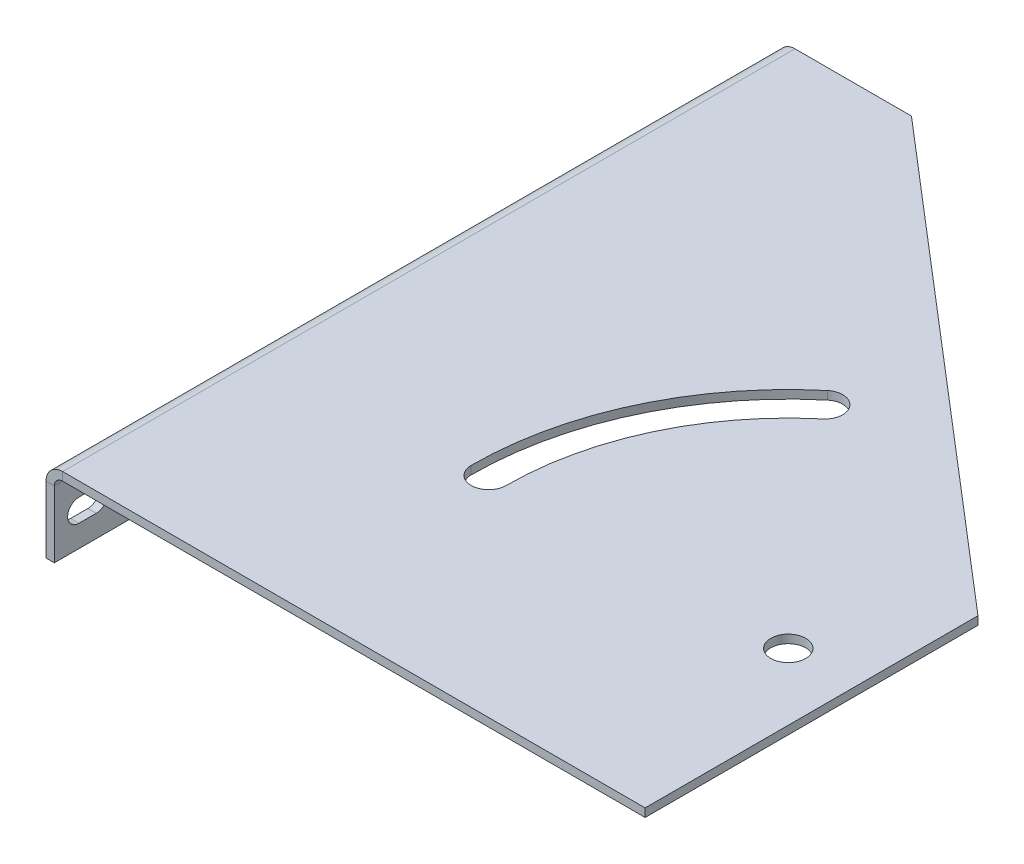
ISO-10303-21;
HEADER;
FILE_DESCRIPTION(('STEP AP214'),'2;1');
FILE_NAME('part.step','',(''),(''),'','','');
FILE_SCHEMA(('AUTOMOTIVE_DESIGN { 1 0 10303 214 1 1 1 1 }'));
ENDSEC;
DATA;
#1=APPLICATION_CONTEXT('core data for automotive mechanical design processes');
#2=APPLICATION_PROTOCOL_DEFINITION('international standard','automotive_design',2000,#1);
#3=PRODUCT_CONTEXT('',#1,'mechanical');
#4=PRODUCT('Part','Part','',(#3));
#5=PRODUCT_RELATED_PRODUCT_CATEGORY('part','',(#4));
#6=PRODUCT_DEFINITION_FORMATION('','',#4);
#7=PRODUCT_DEFINITION_CONTEXT('part definition',#1,'design');
#8=PRODUCT_DEFINITION('design','',#6,#7);
#9=PRODUCT_DEFINITION_SHAPE('','',#8);
#10=(LENGTH_UNIT() NAMED_UNIT(*) SI_UNIT(.MILLI.,.METRE.));
#11=(NAMED_UNIT(*) PLANE_ANGLE_UNIT() SI_UNIT($,.RADIAN.));
#12=(NAMED_UNIT(*) SI_UNIT($,.STERADIAN.) SOLID_ANGLE_UNIT());
#13=UNCERTAINTY_MEASURE_WITH_UNIT(LENGTH_MEASURE(1.E-05),#10,'distance_accuracy_value','');
#14=(GEOMETRIC_REPRESENTATION_CONTEXT(3) GLOBAL_UNCERTAINTY_ASSIGNED_CONTEXT((#13)) GLOBAL_UNIT_ASSIGNED_CONTEXT((#10,
#11,#12)) REPRESENTATION_CONTEXT('',''));
#15=CARTESIAN_POINT('',(0.,0.,0.));
#16=DIRECTION('',(0.,0.,1.));
#17=DIRECTION('',(1.,0.,0.));
#18=AXIS2_PLACEMENT_3D('',#15,#16,#17);
#19=CARTESIAN_POINT('',(0.,20.,-220.));
#20=DIRECTION('',(0.,0.,-1.));
#21=DIRECTION('',(-1.,0.,0.));
#22=AXIS2_PLACEMENT_3D('',#19,#20,#21);
#23=PLANE('',#22);
#24=DIRECTION('',(1.,0.,0.));
#25=VECTOR('',#24,1.);
#26=CARTESIAN_POINT('',(0.,20.,-220.));
#27=LINE('',#26,#25);
#28=CARTESIAN_POINT('',(0.,20.,-220.));
#29=VERTEX_POINT('',#28);
#30=CARTESIAN_POINT('',(2.5,20.,-220.));
#31=VERTEX_POINT('',#30);
#32=EDGE_CURVE('E361',#29,#31,#27,.T.);
#33=ORIENTED_EDGE('',*,*,#32,.F.);
#34=CARTESIAN_POINT('',(5.,20.,-220.));
#35=DIRECTION('',(0.,0.,1.));
#36=DIRECTION('',(1.,0.,0.));
#37=AXIS2_PLACEMENT_3D('',#34,#35,#36);
#38=CIRCLE('',#37,5.);
#39=CARTESIAN_POINT('',(5.,25.,-220.));
#40=VERTEX_POINT('',#39);
#41=EDGE_CURVE('E305',#29,#40,#38,.F.);
#42=ORIENTED_EDGE('',*,*,#41,.T.);
#43=DIRECTION('',(0.,1.,0.));
#44=VECTOR('',#43,1.);
#45=CARTESIAN_POINT('',(5.,22.5,-220.));
#46=LINE('',#45,#44);
#47=CARTESIAN_POINT('',(5.,22.5,-220.));
#48=VERTEX_POINT('',#47);
#49=EDGE_CURVE('E358',#48,#40,#46,.T.);
#50=ORIENTED_EDGE('',*,*,#49,.F.);
#51=CARTESIAN_POINT('',(5.,20.,-220.));
#52=DIRECTION('',(0.,0.,1.));
#53=DIRECTION('',(1.,0.,0.));
#54=AXIS2_PLACEMENT_3D('',#51,#52,#53);
#55=CIRCLE('',#54,2.5);
#56=EDGE_CURVE('E319',#31,#48,#55,.F.);
#57=ORIENTED_EDGE('',*,*,#56,.F.);
#58=EDGE_LOOP('',(#33,#42,#50,#57));
#59=FACE_BOUND('',#58,.T.);
#60=ADVANCED_FACE('F52',(#59),#23,.T.);
#61=CARTESIAN_POINT('',(5.,22.5,-220.));
#62=DIRECTION('',(0.,0.,-1.));
#63=DIRECTION('',(-1.,0.,0.));
#64=AXIS2_PLACEMENT_3D('',#61,#62,#63);
#65=PLANE('',#64);
#66=DIRECTION('',(0.,1.,0.));
#67=VECTOR('',#66,1.);
#68=CARTESIAN_POINT('',(0.,0.,-220.));
#69=LINE('',#68,#67);
#70=CARTESIAN_POINT('',(0.,0.,-220.));
#71=VERTEX_POINT('',#70);
#72=EDGE_CURVE('E309',#71,#29,#69,.T.);
#73=ORIENTED_EDGE('',*,*,#72,.T.);
#74=ORIENTED_EDGE('',*,*,#32,.T.);
#75=DIRECTION('',(0.,1.,0.));
#76=VECTOR('',#75,1.);
#77=CARTESIAN_POINT('',(2.5,0.,-220.));
#78=LINE('',#77,#76);
#79=CARTESIAN_POINT('',(2.5,0.,-220.));
#80=VERTEX_POINT('',#79);
#81=EDGE_CURVE('E315',#80,#31,#78,.T.);
#82=ORIENTED_EDGE('',*,*,#81,.F.);
#83=DIRECTION('',(-1.,0.,0.));
#84=VECTOR('',#83,1.);
#85=CARTESIAN_POINT('',(2.5,0.,-220.));
#86=LINE('',#85,#84);
#87=EDGE_CURVE('E313',#80,#71,#86,.T.);
#88=ORIENTED_EDGE('',*,*,#87,.T.);
#89=EDGE_LOOP('',(#73,#74,#82,#88));
#90=FACE_BOUND('',#89,.T.);
#91=ADVANCED_FACE('F422',(#90),#65,.T.);
#92=CARTESIAN_POINT('',(5.,25.,0.));
#93=DIRECTION('',(0.,0.,1.));
#94=DIRECTION('',(1.,0.,0.));
#95=AXIS2_PLACEMENT_3D('',#92,#93,#94);
#96=PLANE('',#95);
#97=DIRECTION('',(0.,-1.,0.));
#98=VECTOR('',#97,1.);
#99=CARTESIAN_POINT('',(5.,25.,0.));
#100=LINE('',#99,#98);
#101=CARTESIAN_POINT('',(5.,25.,0.));
#102=VERTEX_POINT('',#101);
#103=CARTESIAN_POINT('',(5.,22.5,0.));
#104=VERTEX_POINT('',#103);
#105=EDGE_CURVE('E355',#102,#104,#100,.T.);
#106=ORIENTED_EDGE('',*,*,#105,.F.);
#107=CARTESIAN_POINT('',(5.,20.,0.));
#108=DIRECTION('',(0.,0.,1.));
#109=DIRECTION('',(1.,0.,0.));
#110=AXIS2_PLACEMENT_3D('',#107,#108,#109);
#111=CIRCLE('',#110,5.);
#112=CARTESIAN_POINT('',(0.,20.,0.));
#113=VERTEX_POINT('',#112);
#114=EDGE_CURVE('E278',#113,#102,#111,.F.);
#115=ORIENTED_EDGE('',*,*,#114,.F.);
#116=DIRECTION('',(-1.,0.,0.));
#117=VECTOR('',#116,1.);
#118=CARTESIAN_POINT('',(2.5,20.,0.));
#119=LINE('',#118,#117);
#120=CARTESIAN_POINT('',(2.5,20.,0.));
#121=VERTEX_POINT('',#120);
#122=EDGE_CURVE('E328',#121,#113,#119,.T.);
#123=ORIENTED_EDGE('',*,*,#122,.F.);
#124=CARTESIAN_POINT('',(5.,20.,0.));
#125=DIRECTION('',(0.,0.,1.));
#126=DIRECTION('',(1.,0.,0.));
#127=AXIS2_PLACEMENT_3D('',#124,#125,#126);
#128=CIRCLE('',#127,2.5);
#129=EDGE_CURVE('E293',#121,#104,#128,.F.);
#130=ORIENTED_EDGE('',*,*,#129,.T.);
#131=EDGE_LOOP('',(#106,#115,#123,#130));
#132=FACE_BOUND('',#131,.T.);
#133=ADVANCED_FACE('F406',(#132),#96,.T.);
#134=CARTESIAN_POINT('',(2.5,20.,0.));
#135=DIRECTION('',(0.,0.,1.));
#136=DIRECTION('',(1.,0.,0.));
#137=AXIS2_PLACEMENT_3D('',#134,#135,#136);
#138=PLANE('',#137);
#139=DIRECTION('',(1.,0.,0.));
#140=VECTOR('',#139,1.);
#141=CARTESIAN_POINT('',(0.,25.,0.));
#142=LINE('',#141,#140);
#143=CARTESIAN_POINT('',(180.,25.,0.));
#144=VERTEX_POINT('',#143);
#145=EDGE_CURVE('E274',#102,#144,#142,.T.);
#146=ORIENTED_EDGE('',*,*,#145,.F.);
#147=ORIENTED_EDGE('',*,*,#105,.T.);
#148=DIRECTION('',(1.,0.,0.));
#149=VECTOR('',#148,1.);
#150=CARTESIAN_POINT('',(0.,22.5,0.));
#151=LINE('',#150,#149);
#152=CARTESIAN_POINT('',(180.,22.5,0.));
#153=VERTEX_POINT('',#152);
#154=EDGE_CURVE('E266',#104,#153,#151,.T.);
#155=ORIENTED_EDGE('',*,*,#154,.T.);
#156=DIRECTION('',(0.,-1.,0.));
#157=VECTOR('',#156,1.);
#158=CARTESIAN_POINT('',(180.,25.,0.));
#159=LINE('',#158,#157);
#160=EDGE_CURVE('E270',#144,#153,#159,.T.);
#161=ORIENTED_EDGE('',*,*,#160,.F.);
#162=EDGE_LOOP('',(#146,#147,#155,#161));
#163=FACE_BOUND('',#162,.T.);
#164=ADVANCED_FACE('F404',(#163),#138,.T.);
#165=CARTESIAN_POINT('',(0.,22.5,-220.));
#166=DIRECTION('',(0.,-1.,0.));
#167=DIRECTION('',(0.,0.,-1.));
#168=AXIS2_PLACEMENT_3D('',#165,#166,#167);
#169=PLANE('',#168);
#170=CARTESIAN_POINT('',(160.,22.5,-63.));
#171=DIRECTION('',(0.,-1.,0.));
#172=DIRECTION('',(0.,0.,-1.));
#173=AXIS2_PLACEMENT_3D('',#170,#171,#172);
#174=CIRCLE('',#173,84.75);
#175=CARTESIAN_POINT('',(105.523750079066,22.5,-127.922266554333));
#176=VERTEX_POINT('',#175);
#177=CARTESIAN_POINT('',(75.25,22.5,-63.));
#178=VERTEX_POINT('',#177);
#179=EDGE_CURVE('E256',#176,#178,#174,.F.);
#180=ORIENTED_EDGE('',*,*,#179,.F.);
#181=CARTESIAN_POINT('',(102.149115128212,22.5,-131.943999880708));
#182=DIRECTION('',(0.,-1.,0.));
#183=DIRECTION('',(0.,0.,-1.));
#184=AXIS2_PLACEMENT_3D('',#181,#182,#183);
#185=CIRCLE('',#184,5.25);
#186=CARTESIAN_POINT('',(98.7744801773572,22.5,-135.965733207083));
#187=VERTEX_POINT('',#186);
#188=EDGE_CURVE('E237',#187,#176,#185,.T.);
#189=ORIENTED_EDGE('',*,*,#188,.F.);
#190=CARTESIAN_POINT('',(160.,22.5,-63.));
#191=DIRECTION('',(0.,-1.,0.));
#192=DIRECTION('',(0.,0.,-1.));
#193=AXIS2_PLACEMENT_3D('',#190,#191,#192);
#194=CIRCLE('',#193,95.25);
#195=CARTESIAN_POINT('',(64.75,22.5,-63.));
#196=VERTEX_POINT('',#195);
#197=EDGE_CURVE('E249',#196,#187,#194,.T.);
#198=ORIENTED_EDGE('',*,*,#197,.F.);
#199=CARTESIAN_POINT('',(70.,22.5,-63.));
#200=DIRECTION('',(0.,-1.,0.));
#201=DIRECTION('',(0.,0.,-1.));
#202=AXIS2_PLACEMENT_3D('',#199,#200,#201);
#203=CIRCLE('',#202,5.25);
#204=EDGE_CURVE('E253',#178,#196,#203,.T.);
#205=ORIENTED_EDGE('',*,*,#204,.F.);
#206=EDGE_LOOP('',(#180,#189,#198,#205));
#207=FACE_BOUND('',#206,.T.);
#208=CARTESIAN_POINT('',(160.,22.5,-63.));
#209=DIRECTION('',(0.,-1.,0.));
#210=DIRECTION('',(0.,0.,-1.));
#211=AXIS2_PLACEMENT_3D('',#208,#209,#210);
#212=CIRCLE('',#211,5.25);
#213=CARTESIAN_POINT('',(160.,22.5,-68.25));
#214=VERTEX_POINT('',#213);
#215=EDGE_CURVE('E262',#214,#214,#212,.T.);
#216=ORIENTED_EDGE('',*,*,#215,.F.);
#217=EDGE_LOOP('',(#216));
#218=FACE_BOUND('',#217,.T.);
#219=DIRECTION('',(1.,0.,0.));
#220=VECTOR('',#219,1.);
#221=CARTESIAN_POINT('',(0.,22.5,-220.));
#222=LINE('',#221,#220);
#223=CARTESIAN_POINT('',(39.9999999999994,22.5,-220.));
#224=VERTEX_POINT('',#223);
#225=EDGE_CURVE('E297',#48,#224,#222,.T.);
#226=ORIENTED_EDGE('',*,*,#225,.T.);
#227=DIRECTION('',(-0.759256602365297,0.,-0.650791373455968));
#228=VECTOR('',#227,1.);
#229=CARTESIAN_POINT('',(16.941176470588,22.5,-239.764705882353));
#230=LINE('',#229,#228);
#231=CARTESIAN_POINT('',(180.,22.5,-99.9999999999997));
#232=VERTEX_POINT('',#231);
#233=EDGE_CURVE('E368',#224,#232,#230,.F.);
#234=ORIENTED_EDGE('',*,*,#233,.T.);
#235=DIRECTION('',(0.,0.,1.));
#236=VECTOR('',#235,1.);
#237=CARTESIAN_POINT('',(180.,22.5,-220.));
#238=LINE('',#237,#236);
#239=EDGE_CURVE('E323',#232,#153,#238,.T.);
#240=ORIENTED_EDGE('',*,*,#239,.T.);
#241=ORIENTED_EDGE('',*,*,#154,.F.);
#242=DIRECTION('',(0.,0.,1.));
#243=VECTOR('',#242,1.);
#244=CARTESIAN_POINT('',(5.,22.5,-220.));
#245=LINE('',#244,#243);
#246=EDGE_CURVE('E324',#48,#104,#245,.T.);
#247=ORIENTED_EDGE('',*,*,#246,.F.);
#248=EDGE_LOOP('',(#226,#234,#240,#241,#247));
#249=FACE_BOUND('',#248,.T.);
#250=ADVANCED_FACE('F390',(#207,#218,#249),#169,.T.);
#251=CARTESIAN_POINT('',(5.,20.,-220.));
#252=DIRECTION('',(0.,0.,1.));
#253=DIRECTION('',(1.,0.,0.));
#254=AXIS2_PLACEMENT_3D('',#251,#252,#253);
#255=CYLINDRICAL_SURFACE('',#254,2.5);
#256=ORIENTED_EDGE('',*,*,#129,.F.);
#257=DIRECTION('',(0.,0.,1.));
#258=VECTOR('',#257,1.);
#259=CARTESIAN_POINT('',(2.5,20.,-220.));
#260=LINE('',#259,#258);
#261=EDGE_CURVE('E329',#31,#121,#260,.T.);
#262=ORIENTED_EDGE('',*,*,#261,.F.);
#263=ORIENTED_EDGE('',*,*,#56,.T.);
#264=ORIENTED_EDGE('',*,*,#246,.T.);
#265=EDGE_LOOP('',(#256,#262,#263,#264));
#266=FACE_BOUND('',#265,.T.);
#267=ADVANCED_FACE('F394',(#266),#255,.F.);
#268=CARTESIAN_POINT('',(2.5,0.,-220.));
#269=DIRECTION('',(1.,0.,0.));
#270=DIRECTION('',(0.,0.,-1.));
#271=AXIS2_PLACEMENT_3D('',#268,#269,#270);
#272=PLANE('',#271);
#273=CARTESIAN_POINT('',(2.5,10.,-45.));
#274=DIRECTION('',(1.,0.,0.));
#275=DIRECTION('',(0.,0.,-1.));
#276=AXIS2_PLACEMENT_3D('',#273,#274,#275);
#277=CIRCLE('',#276,3.39999999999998);
#278=CARTESIAN_POINT('',(2.5,10.,-48.4));
#279=VERTEX_POINT('',#278);
#280=EDGE_CURVE('E501',#279,#279,#277,.T.);
#281=ORIENTED_EDGE('',*,*,#280,.F.);
#282=EDGE_LOOP('',(#281));
#283=FACE_BOUND('',#282,.T.);
#284=CARTESIAN_POINT('',(2.5,10.,-205.));
#285=DIRECTION('',(1.,0.,0.));
#286=DIRECTION('',(0.,0.,-1.));
#287=AXIS2_PLACEMENT_3D('',#284,#285,#286);
#288=CIRCLE('',#287,3.39999999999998);
#289=CARTESIAN_POINT('',(2.5,10.,-208.4));
#290=VERTEX_POINT('',#289);
#291=EDGE_CURVE('E514',#290,#290,#288,.T.);
#292=ORIENTED_EDGE('',*,*,#291,.F.);
#293=EDGE_LOOP('',(#292));
#294=FACE_BOUND('',#293,.T.);
#295=CARTESIAN_POINT('',(2.5,9.99999999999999,-12.6));
#296=DIRECTION('',(1.,0.,0.));
#297=DIRECTION('',(0.,0.,-1.));
#298=AXIS2_PLACEMENT_3D('',#295,#296,#297);
#299=CIRCLE('',#298,3.4);
#300=CARTESIAN_POINT('',(2.50000000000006,6.59999999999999,-12.6));
#301=VERTEX_POINT('',#300);
#302=CARTESIAN_POINT('',(2.50000000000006,13.4,-12.6));
#303=VERTEX_POINT('',#302);
#304=EDGE_CURVE('E215',#301,#303,#299,.T.);
#305=ORIENTED_EDGE('',*,*,#304,.F.);
#306=DIRECTION('',(0.,0.,-1.));
#307=VECTOR('',#306,1.);
#308=CARTESIAN_POINT('',(2.5,6.59999999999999,-220.));
#309=LINE('',#308,#307);
#310=CARTESIAN_POINT('',(2.5,6.59999999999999,-7.39999999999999));
#311=VERTEX_POINT('',#310);
#312=EDGE_CURVE('E203',#311,#301,#309,.T.);
#313=ORIENTED_EDGE('',*,*,#312,.F.);
#314=CARTESIAN_POINT('',(2.5,9.99999999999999,-7.39999999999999));
#315=DIRECTION('',(1.,0.,0.));
#316=DIRECTION('',(0.,0.,-1.));
#317=AXIS2_PLACEMENT_3D('',#314,#315,#316);
#318=CIRCLE('',#317,3.4);
#319=CARTESIAN_POINT('',(2.50000000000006,13.4,-7.39999999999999));
#320=VERTEX_POINT('',#319);
#321=EDGE_CURVE('E176',#320,#311,#318,.T.);
#322=ORIENTED_EDGE('',*,*,#321,.F.);
#323=DIRECTION('',(0.,0.,1.));
#324=VECTOR('',#323,1.);
#325=CARTESIAN_POINT('',(2.5,13.4,-220.));
#326=LINE('',#325,#324);
#327=EDGE_CURVE('E212',#303,#320,#326,.T.);
#328=ORIENTED_EDGE('',*,*,#327,.F.);
#329=EDGE_LOOP('',(#305,#313,#322,#328));
#330=FACE_BOUND('',#329,.T.);
#331=DIRECTION('',(0.,1.,0.));
#332=VECTOR('',#331,1.);
#333=CARTESIAN_POINT('',(2.5,0.,0.));
#334=LINE('',#333,#332);
#335=CARTESIAN_POINT('',(2.5,0.,0.));
#336=VERTEX_POINT('',#335);
#337=EDGE_CURVE('E289',#336,#121,#334,.T.);
#338=ORIENTED_EDGE('',*,*,#337,.F.);
#339=DIRECTION('',(0.,0.,1.));
#340=VECTOR('',#339,1.);
#341=CARTESIAN_POINT('',(2.5,0.,-220.));
#342=LINE('',#341,#340);
#343=EDGE_CURVE('E333',#80,#336,#342,.T.);
#344=ORIENTED_EDGE('',*,*,#343,.F.);
#345=ORIENTED_EDGE('',*,*,#81,.T.);
#346=ORIENTED_EDGE('',*,*,#261,.T.);
#347=EDGE_LOOP('',(#338,#344,#345,#346));
#348=FACE_BOUND('',#347,.T.);
#349=ADVANCED_FACE('F411',(#283,#294,#330,#348),#272,.T.);
#350=CARTESIAN_POINT('',(2.5,0.,-220.));
#351=DIRECTION('',(0.,1.,0.));
#352=DIRECTION('',(0.,0.,1.));
#353=AXIS2_PLACEMENT_3D('',#350,#351,#352);
#354=PLANE('',#353);
#355=DIRECTION('',(-1.,0.,0.));
#356=VECTOR('',#355,1.);
#357=CARTESIAN_POINT('',(2.5,0.,0.));
#358=LINE('',#357,#356);
#359=CARTESIAN_POINT('',(0.,0.,0.));
#360=VERTEX_POINT('',#359);
#361=EDGE_CURVE('E286',#336,#360,#358,.T.);
#362=ORIENTED_EDGE('',*,*,#361,.T.);
#363=DIRECTION('',(0.,0.,1.));
#364=VECTOR('',#363,1.);
#365=CARTESIAN_POINT('',(0.,0.,-220.));
#366=LINE('',#365,#364);
#367=EDGE_CURVE('E336',#71,#360,#366,.T.);
#368=ORIENTED_EDGE('',*,*,#367,.F.);
#369=ORIENTED_EDGE('',*,*,#87,.F.);
#370=ORIENTED_EDGE('',*,*,#343,.T.);
#371=EDGE_LOOP('',(#362,#368,#369,#370));
#372=FACE_BOUND('',#371,.T.);
#373=ADVANCED_FACE('F417',(#372),#354,.F.);
#374=CARTESIAN_POINT('',(0.,0.,-220.));
#375=DIRECTION('',(1.,0.,0.));
#376=DIRECTION('',(0.,0.,-1.));
#377=AXIS2_PLACEMENT_3D('',#374,#375,#376);
#378=PLANE('',#377);
#379=CARTESIAN_POINT('',(0.,10.,-45.));
#380=DIRECTION('',(-1.,0.,0.));
#381=DIRECTION('',(0.,0.,1.));
#382=AXIS2_PLACEMENT_3D('',#379,#380,#381);
#383=CIRCLE('',#382,3.39999999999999);
#384=CARTESIAN_POINT('',(0.,10.,-41.6));
#385=VERTEX_POINT('',#384);
#386=EDGE_CURVE('E504',#385,#385,#383,.T.);
#387=ORIENTED_EDGE('',*,*,#386,.F.);
#388=EDGE_LOOP('',(#387));
#389=FACE_BOUND('',#388,.T.);
#390=CARTESIAN_POINT('',(0.,10.,-205.));
#391=DIRECTION('',(-1.,0.,0.));
#392=DIRECTION('',(0.,0.,1.));
#393=AXIS2_PLACEMENT_3D('',#390,#391,#392);
#394=CIRCLE('',#393,3.39999999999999);
#395=CARTESIAN_POINT('',(0.,10.,-201.6));
#396=VERTEX_POINT('',#395);
#397=EDGE_CURVE('E508',#396,#396,#394,.T.);
#398=ORIENTED_EDGE('',*,*,#397,.F.);
#399=EDGE_LOOP('',(#398));
#400=FACE_BOUND('',#399,.T.);
#401=DIRECTION('',(0.,0.,1.));
#402=VECTOR('',#401,1.);
#403=CARTESIAN_POINT('',(0.,6.59999999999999,-12.6));
#404=LINE('',#403,#402);
#405=CARTESIAN_POINT('',(0.,6.59999999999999,-12.6));
#406=VERTEX_POINT('',#405);
#407=CARTESIAN_POINT('',(0.,6.59999999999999,-7.39999999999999));
#408=VERTEX_POINT('',#407);
#409=EDGE_CURVE('E183',#406,#408,#404,.T.);
#410=ORIENTED_EDGE('',*,*,#409,.F.);
#411=CARTESIAN_POINT('',(0.,9.99999999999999,-12.6));
#412=DIRECTION('',(-1.,0.,0.));
#413=DIRECTION('',(0.,0.,-1.));
#414=AXIS2_PLACEMENT_3D('',#411,#412,#413);
#415=CIRCLE('',#414,3.4);
#416=CARTESIAN_POINT('',(0.,13.4,-12.6));
#417=VERTEX_POINT('',#416);
#418=EDGE_CURVE('E75',#417,#406,#415,.T.);
#419=ORIENTED_EDGE('',*,*,#418,.F.);
#420=DIRECTION('',(0.,0.,-1.));
#421=VECTOR('',#420,1.);
#422=CARTESIAN_POINT('',(0.,13.4,-12.6));
#423=LINE('',#422,#421);
#424=CARTESIAN_POINT('',(0.,13.4,-7.39999999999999));
#425=VERTEX_POINT('',#424);
#426=EDGE_CURVE('E191',#425,#417,#423,.T.);
#427=ORIENTED_EDGE('',*,*,#426,.F.);
#428=CARTESIAN_POINT('',(0.,9.99999999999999,-7.39999999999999));
#429=DIRECTION('',(-1.,0.,0.));
#430=DIRECTION('',(0.,0.,1.));
#431=AXIS2_PLACEMENT_3D('',#428,#429,#430);
#432=CIRCLE('',#431,3.4);
#433=EDGE_CURVE('E173',#408,#425,#432,.T.);
#434=ORIENTED_EDGE('',*,*,#433,.F.);
#435=EDGE_LOOP('',(#410,#419,#427,#434));
#436=FACE_BOUND('',#435,.T.);
#437=DIRECTION('',(0.,1.,0.));
#438=VECTOR('',#437,1.);
#439=CARTESIAN_POINT('',(0.,0.,0.));
#440=LINE('',#439,#438);
#441=EDGE_CURVE('E282',#360,#113,#440,.T.);
#442=ORIENTED_EDGE('',*,*,#441,.T.);
#443=DIRECTION('',(0.,0.,1.));
#444=VECTOR('',#443,1.);
#445=CARTESIAN_POINT('',(0.,20.,-220.));
#446=LINE('',#445,#444);
#447=EDGE_CURVE('E340',#29,#113,#446,.T.);
#448=ORIENTED_EDGE('',*,*,#447,.F.);
#449=ORIENTED_EDGE('',*,*,#72,.F.);
#450=ORIENTED_EDGE('',*,*,#367,.T.);
#451=EDGE_LOOP('',(#442,#448,#449,#450));
#452=FACE_BOUND('',#451,.T.);
#453=ADVANCED_FACE('F188',(#389,#400,#436,#452),#378,.F.);
#454=CARTESIAN_POINT('',(5.,20.,-220.));
#455=DIRECTION('',(0.,0.,1.));
#456=DIRECTION('',(1.,0.,0.));
#457=AXIS2_PLACEMENT_3D('',#454,#455,#456);
#458=CYLINDRICAL_SURFACE('',#457,5.);
#459=ORIENTED_EDGE('',*,*,#114,.T.);
#460=DIRECTION('',(0.,0.,1.));
#461=VECTOR('',#460,1.);
#462=CARTESIAN_POINT('',(5.,25.,-220.));
#463=LINE('',#462,#461);
#464=EDGE_CURVE('E344',#40,#102,#463,.T.);
#465=ORIENTED_EDGE('',*,*,#464,.F.);
#466=ORIENTED_EDGE('',*,*,#41,.F.);
#467=ORIENTED_EDGE('',*,*,#447,.T.);
#468=EDGE_LOOP('',(#459,#465,#466,#467));
#469=FACE_BOUND('',#468,.T.);
#470=ADVANCED_FACE('F401',(#469),#458,.T.);
#471=CARTESIAN_POINT('',(0.,25.,-220.));
#472=DIRECTION('',(0.,-1.,0.));
#473=DIRECTION('',(0.,0.,-1.));
#474=AXIS2_PLACEMENT_3D('',#471,#472,#473);
#475=PLANE('',#474);
#476=CARTESIAN_POINT('',(102.149115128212,25.,-131.943999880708));
#477=DIRECTION('',(0.,1.,0.));
#478=DIRECTION('',(0.,0.,1.));
#479=AXIS2_PLACEMENT_3D('',#476,#477,#478);
#480=CIRCLE('',#479,5.25);
#481=CARTESIAN_POINT('',(105.523750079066,25.,-127.922266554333));
#482=VERTEX_POINT('',#481);
#483=CARTESIAN_POINT('',(98.7744801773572,25.,-135.965733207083));
#484=VERTEX_POINT('',#483);
#485=EDGE_CURVE('E221',#482,#484,#480,.T.);
#486=ORIENTED_EDGE('',*,*,#485,.F.);
#487=CARTESIAN_POINT('',(160.,25.,-63.));
#488=DIRECTION('',(0.,-1.,0.));
#489=DIRECTION('',(0.,0.,-1.));
#490=AXIS2_PLACEMENT_3D('',#487,#488,#489);
#491=CIRCLE('',#490,84.75);
#492=CARTESIAN_POINT('',(75.25,25.,-63.));
#493=VERTEX_POINT('',#492);
#494=EDGE_CURVE('E218',#493,#482,#491,.T.);
#495=ORIENTED_EDGE('',*,*,#494,.F.);
#496=CARTESIAN_POINT('',(70.,25.,-63.));
#497=DIRECTION('',(0.,1.,0.));
#498=DIRECTION('',(0.,0.,1.));
#499=AXIS2_PLACEMENT_3D('',#496,#497,#498);
#500=CIRCLE('',#499,5.25);
#501=CARTESIAN_POINT('',(64.75,25.,-63.));
#502=VERTEX_POINT('',#501);
#503=EDGE_CURVE('E229',#502,#493,#500,.T.);
#504=ORIENTED_EDGE('',*,*,#503,.F.);
#505=CARTESIAN_POINT('',(160.,25.,-63.));
#506=DIRECTION('',(0.,1.,0.));
#507=DIRECTION('',(0.,0.,-1.));
#508=AXIS2_PLACEMENT_3D('',#505,#506,#507);
#509=CIRCLE('',#508,95.25);
#510=EDGE_CURVE('E225',#484,#502,#509,.T.);
#511=ORIENTED_EDGE('',*,*,#510,.F.);
#512=EDGE_LOOP('',(#486,#495,#504,#511));
#513=FACE_BOUND('',#512,.T.);
#514=CARTESIAN_POINT('',(160.,25.,-63.));
#515=DIRECTION('',(0.,1.,0.));
#516=DIRECTION('',(0.,0.,1.));
#517=AXIS2_PLACEMENT_3D('',#514,#515,#516);
#518=CIRCLE('',#517,5.25);
#519=CARTESIAN_POINT('',(160.,25.,-57.75));
#520=VERTEX_POINT('',#519);
#521=EDGE_CURVE('E258',#520,#520,#518,.T.);
#522=ORIENTED_EDGE('',*,*,#521,.F.);
#523=EDGE_LOOP('',(#522));
#524=FACE_BOUND('',#523,.T.);
#525=DIRECTION('',(0.,0.,1.));
#526=VECTOR('',#525,1.);
#527=CARTESIAN_POINT('',(180.,25.,-220.));
#528=LINE('',#527,#526);
#529=CARTESIAN_POINT('',(180.,25.,-99.9999999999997));
#530=VERTEX_POINT('',#529);
#531=EDGE_CURVE('E348',#530,#144,#528,.T.);
#532=ORIENTED_EDGE('',*,*,#531,.F.);
#533=DIRECTION('',(0.759256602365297,0.,0.650791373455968));
#534=VECTOR('',#533,1.);
#535=CARTESIAN_POINT('',(39.9999999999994,25.,-220.));
#536=LINE('',#535,#534);
#537=CARTESIAN_POINT('',(39.9999999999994,25.,-220.));
#538=VERTEX_POINT('',#537);
#539=EDGE_CURVE('E11',#530,#538,#536,.F.);
#540=ORIENTED_EDGE('',*,*,#539,.T.);
#541=DIRECTION('',(1.,0.,0.));
#542=VECTOR('',#541,1.);
#543=CARTESIAN_POINT('',(0.,25.,-220.));
#544=LINE('',#543,#542);
#545=EDGE_CURVE('E301',#40,#538,#544,.T.);
#546=ORIENTED_EDGE('',*,*,#545,.F.);
#547=ORIENTED_EDGE('',*,*,#464,.T.);
#548=ORIENTED_EDGE('',*,*,#145,.T.);
#549=EDGE_LOOP('',(#532,#540,#546,#547,#548));
#550=FACE_BOUND('',#549,.T.);
#551=ADVANCED_FACE('F379',(#513,#524,#550),#475,.F.);
#552=CARTESIAN_POINT('',(180.,25.,-220.));
#553=DIRECTION('',(-1.,0.,0.));
#554=DIRECTION('',(0.,0.,1.));
#555=AXIS2_PLACEMENT_3D('',#552,#553,#554);
#556=PLANE('',#555);
#557=ORIENTED_EDGE('',*,*,#239,.F.);
#558=DIRECTION('',(0.,1.,0.));
#559=VECTOR('',#558,1.);
#560=CARTESIAN_POINT('',(180.,25.,-99.9999999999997));
#561=LINE('',#560,#559);
#562=EDGE_CURVE('E60',#232,#530,#561,.T.);
#563=ORIENTED_EDGE('',*,*,#562,.T.);
#564=ORIENTED_EDGE('',*,*,#531,.T.);
#565=ORIENTED_EDGE('',*,*,#160,.T.);
#566=EDGE_LOOP('',(#557,#563,#564,#565));
#567=FACE_BOUND('',#566,.T.);
#568=ADVANCED_FACE('F375',(#567),#556,.F.);
#569=CARTESIAN_POINT('',(5.,20.,-220.));
#570=DIRECTION('',(0.,0.,1.));
#571=DIRECTION('',(1.,0.,0.));
#572=AXIS2_PLACEMENT_3D('',#569,#570,#571);
#573=PLANE('',#572);
#574=ORIENTED_EDGE('',*,*,#545,.T.);
#575=DIRECTION('',(0.,-1.,0.));
#576=VECTOR('',#575,1.);
#577=CARTESIAN_POINT('',(39.9999999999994,20.,-220.));
#578=LINE('',#577,#576);
#579=EDGE_CURVE('E364',#538,#224,#578,.T.);
#580=ORIENTED_EDGE('',*,*,#579,.T.);
#581=ORIENTED_EDGE('',*,*,#225,.F.);
#582=ORIENTED_EDGE('',*,*,#49,.T.);
#583=EDGE_LOOP('',(#574,#580,#581,#582));
#584=FACE_BOUND('',#583,.T.);
#585=ADVANCED_FACE('F387',(#584),#573,.F.);
#586=CARTESIAN_POINT('',(5.,20.,0.));
#587=DIRECTION('',(0.,0.,1.));
#588=DIRECTION('',(1.,0.,0.));
#589=AXIS2_PLACEMENT_3D('',#586,#587,#588);
#590=PLANE('',#589);
#591=ORIENTED_EDGE('',*,*,#337,.T.);
#592=ORIENTED_EDGE('',*,*,#122,.T.);
#593=ORIENTED_EDGE('',*,*,#441,.F.);
#594=ORIENTED_EDGE('',*,*,#361,.F.);
#595=EDGE_LOOP('',(#591,#592,#593,#594));
#596=FACE_BOUND('',#595,.T.);
#597=ADVANCED_FACE('F414',(#596),#590,.T.);
#598=CARTESIAN_POINT('',(39.9999999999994,20.,-220.));
#599=DIRECTION('',(-0.650791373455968,0.,0.759256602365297));
#600=DIRECTION('',(0.759256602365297,0.,0.650791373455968));
#601=AXIS2_PLACEMENT_3D('',#598,#599,#600);
#602=PLANE('',#601);
#603=ORIENTED_EDGE('',*,*,#539,.F.);
#604=ORIENTED_EDGE('',*,*,#562,.F.);
#605=ORIENTED_EDGE('',*,*,#233,.F.);
#606=ORIENTED_EDGE('',*,*,#579,.F.);
#607=EDGE_LOOP('',(#603,#604,#605,#606));
#608=FACE_BOUND('',#607,.T.);
#609=ADVANCED_FACE('F384',(#608),#602,.F.);
#610=CARTESIAN_POINT('',(160.,0.,-63.));
#611=DIRECTION('',(0.,1.,0.));
#612=DIRECTION('',(0.,0.,1.));
#613=AXIS2_PLACEMENT_3D('',#610,#611,#612);
#614=CYLINDRICAL_SURFACE('',#613,5.25);
#615=ORIENTED_EDGE('',*,*,#215,.T.);
#616=EDGE_LOOP('',(#615));
#617=FACE_BOUND('',#616,.T.);
#618=ORIENTED_EDGE('',*,*,#521,.T.);
#619=EDGE_LOOP('',(#618));
#620=FACE_BOUND('',#619,.T.);
#621=ADVANCED_FACE('F458',(#617,#620),#614,.F.);
#622=CARTESIAN_POINT('',(160.,0.,-63.));
#623=DIRECTION('',(0.,1.,0.));
#624=DIRECTION('',(0.,0.,1.));
#625=AXIS2_PLACEMENT_3D('',#622,#623,#624);
#626=CYLINDRICAL_SURFACE('',#625,84.75);
#627=ORIENTED_EDGE('',*,*,#179,.T.);
#628=DIRECTION('',(0.,1.,0.));
#629=VECTOR('',#628,1.);
#630=CARTESIAN_POINT('',(75.25,0.,-63.));
#631=LINE('',#630,#629);
#632=EDGE_CURVE('E234',#178,#493,#631,.T.);
#633=ORIENTED_EDGE('',*,*,#632,.T.);
#634=ORIENTED_EDGE('',*,*,#494,.T.);
#635=DIRECTION('',(0.,1.,0.));
#636=VECTOR('',#635,1.);
#637=CARTESIAN_POINT('',(105.523750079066,0.,-127.922266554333));
#638=LINE('',#637,#636);
#639=EDGE_CURVE('E233',#176,#482,#638,.T.);
#640=ORIENTED_EDGE('',*,*,#639,.F.);
#641=EDGE_LOOP('',(#627,#633,#634,#640));
#642=FACE_BOUND('',#641,.T.);
#643=ADVANCED_FACE('F461',(#642),#626,.T.);
#644=CARTESIAN_POINT('',(70.,0.,-63.));
#645=DIRECTION('',(0.,1.,0.));
#646=DIRECTION('',(0.,0.,1.));
#647=AXIS2_PLACEMENT_3D('',#644,#645,#646);
#648=CYLINDRICAL_SURFACE('',#647,5.25);
#649=ORIENTED_EDGE('',*,*,#204,.T.);
#650=DIRECTION('',(0.,1.,0.));
#651=VECTOR('',#650,1.);
#652=CARTESIAN_POINT('',(64.75,0.,-63.));
#653=LINE('',#652,#651);
#654=EDGE_CURVE('E238',#196,#502,#653,.T.);
#655=ORIENTED_EDGE('',*,*,#654,.T.);
#656=ORIENTED_EDGE('',*,*,#503,.T.);
#657=ORIENTED_EDGE('',*,*,#632,.F.);
#658=EDGE_LOOP('',(#649,#655,#656,#657));
#659=FACE_BOUND('',#658,.T.);
#660=ADVANCED_FACE('F465',(#659),#648,.F.);
#661=CARTESIAN_POINT('',(160.,0.,-63.));
#662=DIRECTION('',(0.,1.,0.));
#663=DIRECTION('',(0.,0.,1.));
#664=AXIS2_PLACEMENT_3D('',#661,#662,#663);
#665=CYLINDRICAL_SURFACE('',#664,95.25);
#666=ORIENTED_EDGE('',*,*,#197,.T.);
#667=DIRECTION('',(0.,1.,0.));
#668=VECTOR('',#667,1.);
#669=CARTESIAN_POINT('',(98.7744801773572,0.,-135.965733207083));
#670=LINE('',#669,#668);
#671=EDGE_CURVE('E241',#187,#484,#670,.T.);
#672=ORIENTED_EDGE('',*,*,#671,.T.);
#673=ORIENTED_EDGE('',*,*,#510,.T.);
#674=ORIENTED_EDGE('',*,*,#654,.F.);
#675=EDGE_LOOP('',(#666,#672,#673,#674));
#676=FACE_BOUND('',#675,.T.);
#677=ADVANCED_FACE('F471',(#676),#665,.F.);
#678=CARTESIAN_POINT('',(102.149115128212,0.,-131.943999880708));
#679=DIRECTION('',(0.,1.,0.));
#680=DIRECTION('',(0.,0.,1.));
#681=AXIS2_PLACEMENT_3D('',#678,#679,#680);
#682=CYLINDRICAL_SURFACE('',#681,5.25);
#683=ORIENTED_EDGE('',*,*,#188,.T.);
#684=ORIENTED_EDGE('',*,*,#639,.T.);
#685=ORIENTED_EDGE('',*,*,#485,.T.);
#686=ORIENTED_EDGE('',*,*,#671,.F.);
#687=EDGE_LOOP('',(#683,#684,#685,#686));
#688=FACE_BOUND('',#687,.T.);
#689=ADVANCED_FACE('F467',(#688),#682,.F.);
#690=CARTESIAN_POINT('',(180.,9.99999999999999,-12.6));
#691=DIRECTION('',(-1.,0.,0.));
#692=DIRECTION('',(0.,0.,1.));
#693=AXIS2_PLACEMENT_3D('',#690,#691,#692);
#694=CYLINDRICAL_SURFACE('',#693,3.4);
#695=ORIENTED_EDGE('',*,*,#304,.T.);
#696=DIRECTION('',(-1.,0.,0.));
#697=VECTOR('',#696,1.);
#698=CARTESIAN_POINT('',(180.,13.4,-12.6));
#699=LINE('',#698,#697);
#700=EDGE_CURVE('E200',#303,#417,#699,.T.);
#701=ORIENTED_EDGE('',*,*,#700,.T.);
#702=ORIENTED_EDGE('',*,*,#418,.T.);
#703=DIRECTION('',(-1.,0.,0.));
#704=VECTOR('',#703,1.);
#705=CARTESIAN_POINT('',(180.,6.59999999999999,-12.6));
#706=LINE('',#705,#704);
#707=EDGE_CURVE('E180',#301,#406,#706,.T.);
#708=ORIENTED_EDGE('',*,*,#707,.F.);
#709=EDGE_LOOP('',(#695,#701,#702,#708));
#710=FACE_BOUND('',#709,.T.);
#711=ADVANCED_FACE('F470',(#710),#694,.F.);
#712=CARTESIAN_POINT('',(180.,13.4,-12.6));
#713=DIRECTION('',(0.,1.,0.));
#714=DIRECTION('',(0.,0.,1.));
#715=AXIS2_PLACEMENT_3D('',#712,#713,#714);
#716=PLANE('',#715);
#717=ORIENTED_EDGE('',*,*,#327,.T.);
#718=DIRECTION('',(-1.,0.,0.));
#719=VECTOR('',#718,1.);
#720=CARTESIAN_POINT('',(180.,13.4,-7.39999999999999));
#721=LINE('',#720,#719);
#722=EDGE_CURVE('E179',#320,#425,#721,.T.);
#723=ORIENTED_EDGE('',*,*,#722,.T.);
#724=ORIENTED_EDGE('',*,*,#426,.T.);
#725=ORIENTED_EDGE('',*,*,#700,.F.);
#726=EDGE_LOOP('',(#717,#723,#724,#725));
#727=FACE_BOUND('',#726,.T.);
#728=ADVANCED_FACE('F481',(#727),#716,.F.);
#729=CARTESIAN_POINT('',(180.,9.99999999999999,-7.39999999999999));
#730=DIRECTION('',(-1.,0.,0.));
#731=DIRECTION('',(0.,0.,1.));
#732=AXIS2_PLACEMENT_3D('',#729,#730,#731);
#733=CYLINDRICAL_SURFACE('',#732,3.4);
#734=ORIENTED_EDGE('',*,*,#321,.T.);
#735=DIRECTION('',(-1.,0.,0.));
#736=VECTOR('',#735,1.);
#737=CARTESIAN_POINT('',(180.,6.59999999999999,-7.39999999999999));
#738=LINE('',#737,#736);
#739=EDGE_CURVE('E67',#311,#408,#738,.T.);
#740=ORIENTED_EDGE('',*,*,#739,.T.);
#741=ORIENTED_EDGE('',*,*,#433,.T.);
#742=ORIENTED_EDGE('',*,*,#722,.F.);
#743=EDGE_LOOP('',(#734,#740,#741,#742));
#744=FACE_BOUND('',#743,.T.);
#745=ADVANCED_FACE('F170',(#744),#733,.F.);
#746=CARTESIAN_POINT('',(180.,6.59999999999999,-12.6));
#747=DIRECTION('',(0.,-1.,0.));
#748=DIRECTION('',(0.,0.,-1.));
#749=AXIS2_PLACEMENT_3D('',#746,#747,#748);
#750=PLANE('',#749);
#751=ORIENTED_EDGE('',*,*,#312,.T.);
#752=ORIENTED_EDGE('',*,*,#707,.T.);
#753=ORIENTED_EDGE('',*,*,#409,.T.);
#754=ORIENTED_EDGE('',*,*,#739,.F.);
#755=EDGE_LOOP('',(#751,#752,#753,#754));
#756=FACE_BOUND('',#755,.T.);
#757=ADVANCED_FACE('F184',(#756),#750,.F.);
#758=CARTESIAN_POINT('',(0.,10.,-205.));
#759=DIRECTION('',(-1.,0.,0.));
#760=DIRECTION('',(0.,0.,1.));
#761=AXIS2_PLACEMENT_3D('',#758,#759,#760);
#762=CYLINDRICAL_SURFACE('',#761,3.39999999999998);
#763=ORIENTED_EDGE('',*,*,#291,.T.);
#764=EDGE_LOOP('',(#763));
#765=FACE_BOUND('',#764,.T.);
#766=ORIENTED_EDGE('',*,*,#397,.T.);
#767=EDGE_LOOP('',(#766));
#768=FACE_BOUND('',#767,.T.);
#769=ADVANCED_FACE('F484',(#765,#768),#762,.F.);
#770=CARTESIAN_POINT('',(0.,10.,-45.));
#771=DIRECTION('',(-1.,0.,0.));
#772=DIRECTION('',(0.,0.,1.));
#773=AXIS2_PLACEMENT_3D('',#770,#771,#772);
#774=CYLINDRICAL_SURFACE('',#773,3.39999999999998);
#775=ORIENTED_EDGE('',*,*,#280,.T.);
#776=EDGE_LOOP('',(#775));
#777=FACE_BOUND('',#776,.T.);
#778=ORIENTED_EDGE('',*,*,#386,.T.);
#779=EDGE_LOOP('',(#778));
#780=FACE_BOUND('',#779,.T.);
#781=ADVANCED_FACE('F492',(#777,#780),#774,.F.);
#782=CLOSED_SHELL('',(#60,#91,#133,#164,#250,#267,#349,#373,#453,#470,#551,#568,#585,#597,#609,
#621,#643,#660,#677,#689,#711,#728,#745,#757,#769,#781));
#783=MANIFOLD_SOLID_BREP('B2',#782);
#784=ADVANCED_BREP_SHAPE_REPRESENTATION('',(#18,#783),#14);
#785=SHAPE_DEFINITION_REPRESENTATION(#9,#784);
ENDSEC;
END-ISO-10303-21;
